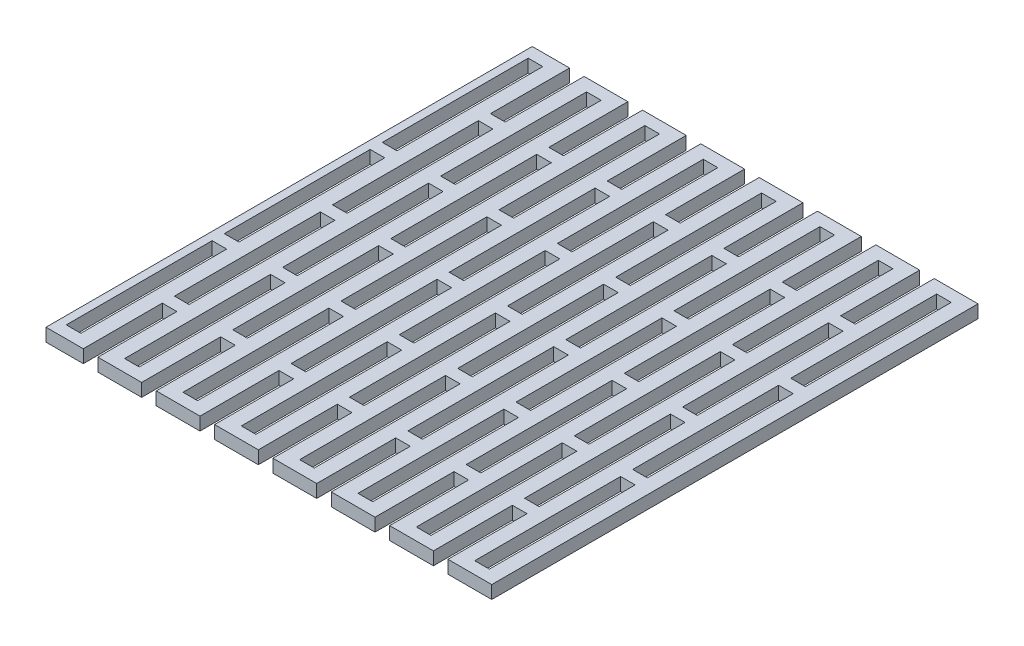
from build123d import *

# Parameters (mm, degrees)
SKETCH1_W           = 275
SKETCH1_H           = 300
BOSS_EXTRUDE1_DEPTH = 8
SKETCH2_W           = 9
SKETCH2_H           = 90
CUT_EXTRUDE3_DEPTH  = 8
LPATTERN1_COUNT     = 8
LPATTERN1_PITCH     = 36


with BuildPart() as part:
    # Sketch1 → Boss-Extrude1 (new body)
    with BuildSketch(Plane(origin=(0, 0, 0), x_dir=(1, 0, 0), z_dir=(0, 1, 0))):
        Rectangle(SKETCH1_W, SKETCH1_H)
    extrude(amount=BOSS_EXTRUDE1_DEPTH)

    # Sketch2 → Cut-Extrude3 (cut, symmetric)
    with BuildSketch(Plane(origin=(0, 0, 0), x_dir=(1, 0, 0), z_dir=(0, 1, 0))):
        with Locations((124, -97.5)):
            Rectangle(SKETCH2_W, SKETCH2_H)
        with Locations((124, 0)):
            Rectangle(SKETCH2_W, SKETCH2_H)
        with Locations((124, 97.5)):
            Rectangle(SKETCH2_W, SKETCH2_H)
        with Locations((106, 48.75)):
            Rectangle(SKETCH2_W, SKETCH2_H)
        with Locations((106, -48.75)):
            Rectangle(SKETCH2_W, SKETCH2_H)
        with Locations((106, -146.25)):
            Rectangle(SKETCH2_W, SKETCH2_H)
        with Locations((106, 146.25)):
            Rectangle(SKETCH2_W, SKETCH2_H)
    cut_extrude3 = extrude(amount=CUT_EXTRUDE3_DEPTH, both=True, mode=Mode.SUBTRACT)

    # LPattern1: Cut-Extrude3 ×8
    with Locations(*[(-i * LPATTERN1_PITCH, 0, 0) for i in range(1, LPATTERN1_COUNT)]):
        add(cut_extrude3, mode=Mode.SUBTRACT)


solid = part.part
